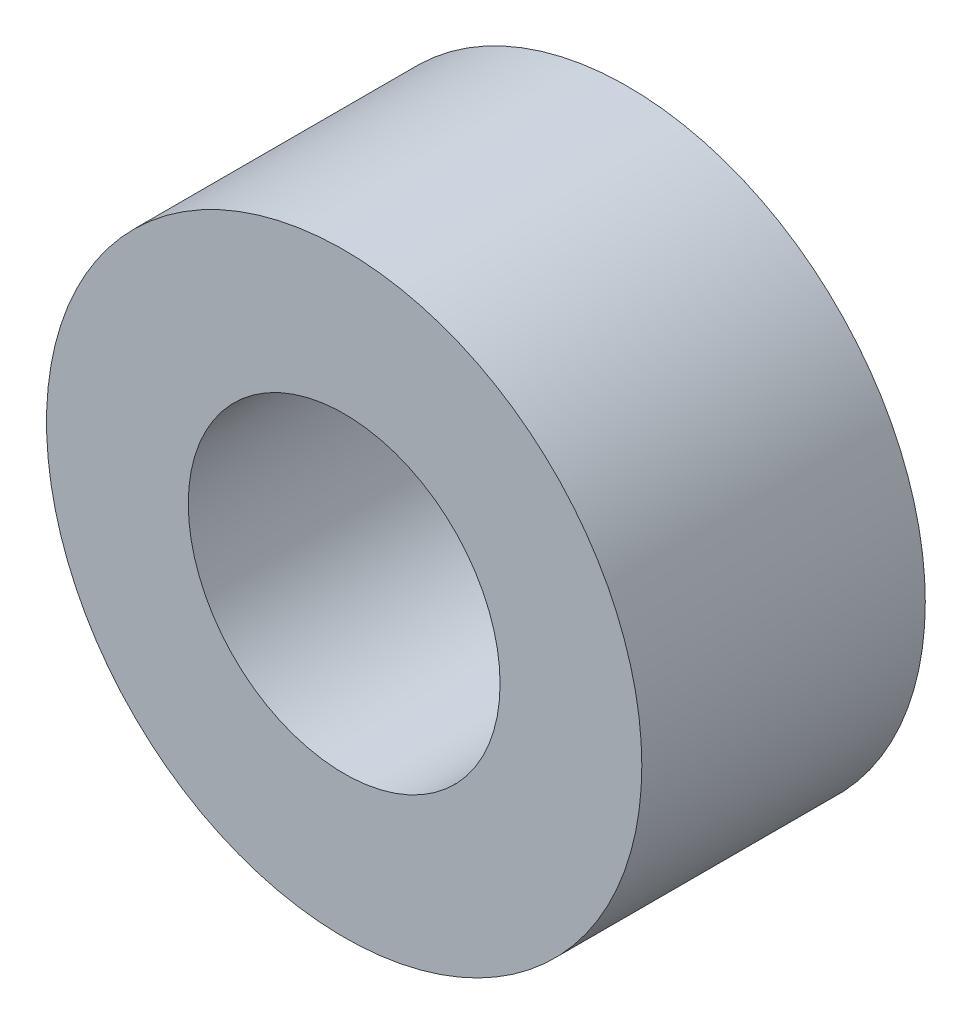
from build123d import *

# Parameters (mm, degrees)
BOSS_EXTRUDE1_DEPTH      = 1
BOSS_EXTRUDE1_DEPTH_BACK = 1
SKETCH1_R                = 2.1
SKETCH1_R_2              = 1.1


with BuildPart() as part:
    # Sketch1 → Boss-Extrude1 (new, two sides: drawn at the far end of the back side and taken through both)
    with BuildSketch(Plane.XY.offset(-BOSS_EXTRUDE1_DEPTH_BACK)):
        Circle(SKETCH1_R)
        Circle(SKETCH1_R_2, mode=Mode.SUBTRACT)
    extrude(amount=BOSS_EXTRUDE1_DEPTH + BOSS_EXTRUDE1_DEPTH_BACK)


solid = part.part
